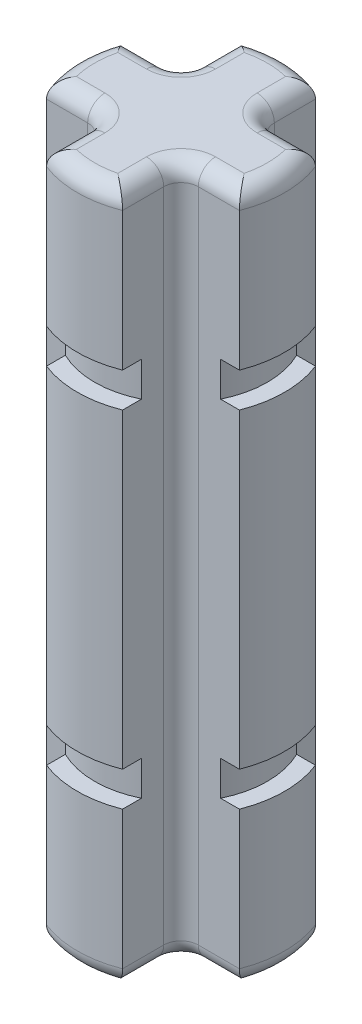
from build123d import *

# Parameters (mm, degrees)
BOSS_EXTRUDE1_DEPTH     = 16
FILLET7_R               = 0.4
CUT_EXTRUDE1_DEPTH      = 0.4
CUT_EXTRUDE1_DEPTH_BACK = 0.4
SKETCH11_R              = 2.4
SKETCH11_R_2            = 2
CUT_EXTRUDE2_DEPTH      = 0.4
CUT_EXTRUDE2_DEPTH_BACK = 0.4
SKETCH12_R              = 2.4
SKETCH12_R_2            = 2


with BuildPart() as part:
    # Sketch1 → Boss-Extrude1 (new body)
    with BuildSketch(Plane(origin=(0, 0, 0), x_dir=(1, 0, 0), z_dir=(0, 1, 0))):
        with BuildLine():
            Line((-2.232845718, 0.88), (-0.88, 0.88))
            Line((-0.88, 0.88), (-0.88, 2.232845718))
            ThreePointArc((-0.88, 2.232845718), (0, 2.4), (0.88, 2.232845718))
            Line((0.88, 2.232845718), (0.88, 0.88))
            Line((0.88, 0.88), (2.232845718, 0.88))
            ThreePointArc((2.232845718, 0.88), (2.4, 0), (2.232845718, -0.88))
            Line((2.232845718, -0.88), (0.88, -0.88))
            Line((0.88, -0.88), (0.88, -2.232845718))
            ThreePointArc((0.88, -2.232845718), (0, -2.4), (-0.88, -2.232845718))
            Line((-0.88, -2.232845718), (-0.88, -0.88))
            Line((-0.88, -0.88), (-2.232845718, -0.88))
            ThreePointArc((-2.232845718, -0.88), (-2.4, 0), (-2.232845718, 0.88))
        make_face()
    extrude(amount=BOSS_EXTRUDE1_DEPTH)

    # Fillet7
    fillet7_edges = [part.edges().sort_by_distance(p)[0] for p in [
        (-2.4, 16, 0),
        (0, 0, -2.4),
        (0.88, 0, -1.556422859),
        (1.556422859, 0, -0.88),
        (2.4, 0, 0),
        (1.556422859, 0, 0.88),
        (0.88, 0, 1.556422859),
        (-1.556422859, 16, 0.88),
        (0, 0, 2.4),
        (-0.88, 0, 1.556422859),
        (-1.556422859, 0, 0.88),
        (-2.4, 0, 0),
        (-1.556422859, 0, -0.88),
        (-0.88, 0, -1.556422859),
        (-0.88, 16, 1.556422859),
        (0, 16, 2.4),
        (0.88, 8, -0.88),
        (0.88, 8, 0.88),
        (-0.88, 8, 0.88),
        (-0.88, 8, -0.88),
        (0.88, 16, 1.556422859),
        (1.556422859, 16, 0.88),
        (2.4, 16, 0),
        (1.556422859, 16, -0.88),
        (0.88, 16, -1.556422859),
        (0, 16, -2.4),
        (-0.88, 16, -1.556422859),
        (-1.556422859, 16, -0.88),
    ]]
    fillet(fillet7_edges, radius=FILLET7_R)

    # Sketch11 → Cut-Extrude1 (cut, two sides: drawn at the far end of the back side and taken through both)
    with BuildSketch(Plane(origin=(0, 12, 0), x_dir=(1, 0, 0), z_dir=(0, 1, 0)).offset(-CUT_EXTRUDE1_DEPTH_BACK)):
        Circle(SKETCH11_R)
        Circle(SKETCH11_R_2, mode=Mode.SUBTRACT)
    extrude(amount=CUT_EXTRUDE1_DEPTH + CUT_EXTRUDE1_DEPTH_BACK, mode=Mode.SUBTRACT)

    # Sketch12 → Cut-Extrude2 (cut, two sides: drawn at the far end of the back side and taken through both)
    with BuildSketch(Plane(origin=(0, 4, 0), x_dir=(-1, 0, 0), z_dir=(0, -1, 0)).offset(-CUT_EXTRUDE2_DEPTH_BACK)):
        Circle(SKETCH12_R)
        Circle(SKETCH12_R_2, mode=Mode.SUBTRACT)
    extrude(amount=CUT_EXTRUDE2_DEPTH + CUT_EXTRUDE2_DEPTH_BACK, mode=Mode.SUBTRACT)


solid = part.part
